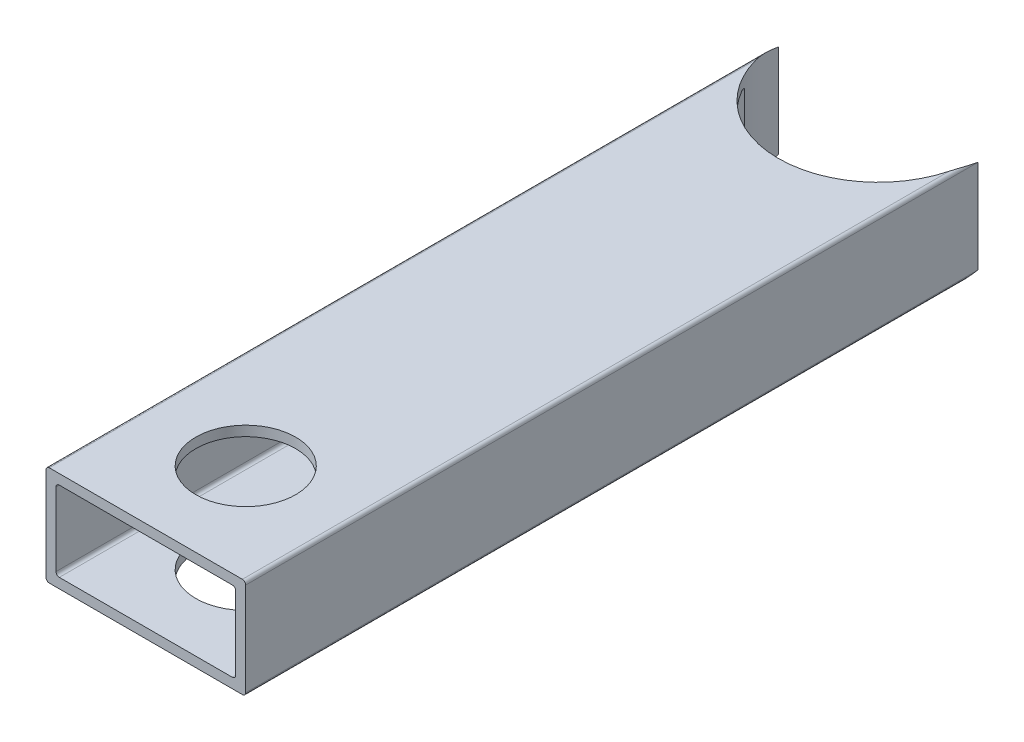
from build123d import *

# Parameters (mm, degrees)
EXTRUSION1_DEPTH        = 220
ESQUISSE3_R             = 30
ENL_V_MAT_EXTRU_2_DEPTH = 231
ESQUISSE4_R             = 15
ENL_V_MAT_EXTRU_3_DEPTH = 231.000000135


with BuildPart() as part:
    # Esquisse1 → Extrusion1 (new body)
    with BuildSketch(Plane.XY):
        with BuildLine():
            Line((1, 0), (59, 0))
            ThreePointArc((59, 0), (59.707106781, 0.292893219), (60, 1))
            Line((60, 1), (60, 29))
            ThreePointArc((60, 29), (59.707106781, 29.707106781), (59, 30))
            Line((59, 30), (1, 30))
            ThreePointArc((1, 30), (0.292893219, 29.707106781), (0, 29))
            Line((0, 29), (0, 1))
            ThreePointArc((0, 1), (0.292893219, 0.292893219), (1, 0))
        make_face()
        with BuildLine():
            Line((4, 27), (56, 27))
            ThreePointArc((56, 27), (56.707106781, 26.707106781), (57, 26))
            Line((57, 26), (57, 4))
            ThreePointArc((57, 4), (56.707106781, 3.292893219), (56, 3))
            Line((56, 3), (4, 3))
            ThreePointArc((4, 3), (3.292893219, 3.292893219), (3, 4))
            Line((3, 4), (3, 26))
            ThreePointArc((3, 26), (3.292893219, 26.707106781), (4, 27))
        make_face(mode=Mode.SUBTRACT)
    extrude(amount=EXTRUSION1_DEPTH)

    # Esquisse3 → Enl_v. mat.-Extru.2 (cut, through all)
    with BuildSketch(Plane(origin=(0, 30, 0), x_dir=(-1, 0, 0), z_dir=(0, 1, 0))):
        with Locations((-30, 0)):
            Circle(ESQUISSE3_R)
    extrude(amount=-ENL_V_MAT_EXTRU_2_DEPTH, mode=Mode.SUBTRACT)

    # Esquisse4 → Enl_v. mat.-Extru.3 (cut, through all)
    with BuildSketch(Plane(origin=(0, 30, 0), x_dir=(-1, 0, 0), z_dir=(0, 1, 0))):
        with Locations(Location((-30, 190, 0), (0, 0, 90))):
            Circle(ESQUISSE4_R)
    extrude(amount=-ENL_V_MAT_EXTRU_3_DEPTH, mode=Mode.SUBTRACT)


solid = part.part
